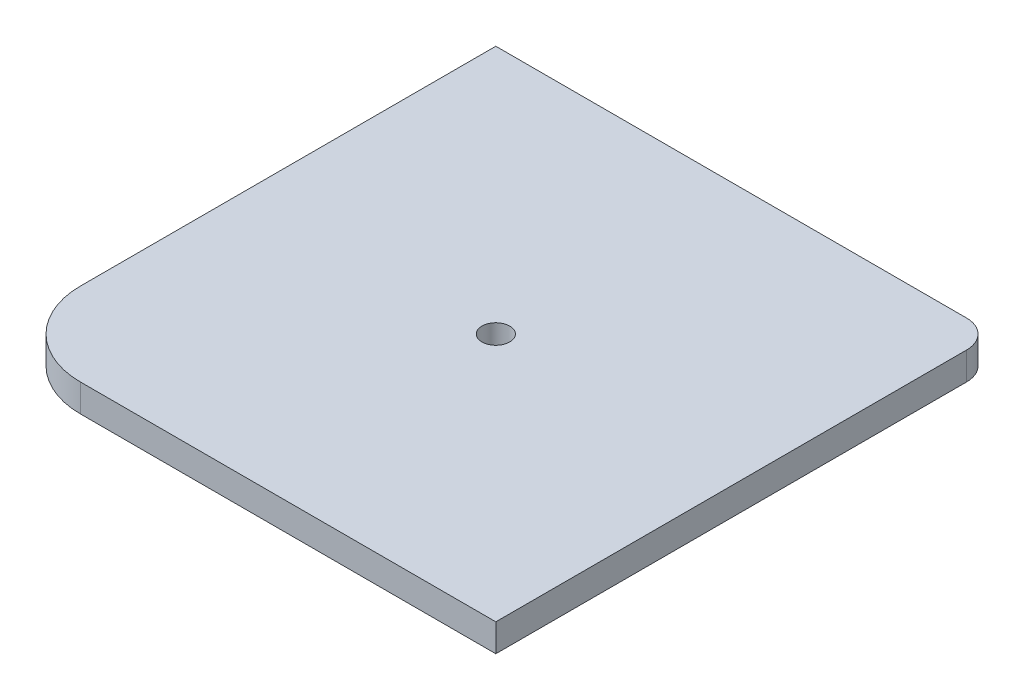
from build123d import *

# Parameters (mm, degrees)
SKETCH1_R      = 2.5
EXTRUDE1_DEPTH = 5


with BuildPart() as part:
    # Sketch1 → Extrude1 (new body)
    with BuildSketch(Plane(origin=(0, 0, 0), x_dir=(1, 0, 0), z_dir=(0, 1, 0))):
        with BuildLine():
            Line((15, 0), (90, 0))
            Line((90, 0), (90, 85))
            ThreePointArc((90, 85), (88.535533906, 88.535533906), (85, 90))
            Line((85, 90), (0, 90))
            Line((0, 90), (0, 15))
            ThreePointArc((0, 15), (4.393398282, 4.393398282), (15, 0))
        make_face()
        with Locations(Location((45, 45, 0), (0, 0, 270))):
            Circle(SKETCH1_R, mode=Mode.SUBTRACT)
    extrude(amount=EXTRUDE1_DEPTH)


solid = part.part
